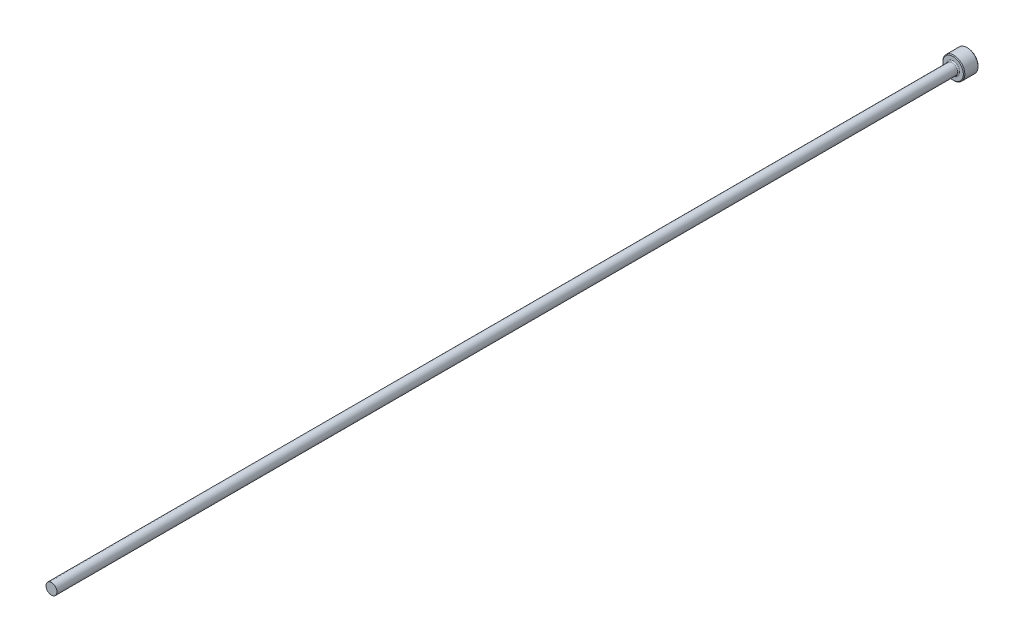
ISO-10303-21;
HEADER;
FILE_DESCRIPTION(('STEP AP214'),'2;1');
FILE_NAME('part.step','',(''),(''),'','','');
FILE_SCHEMA(('AUTOMOTIVE_DESIGN { 1 0 10303 214 1 1 1 1 }'));
ENDSEC;
DATA;
#1=APPLICATION_CONTEXT('core data for automotive mechanical design processes');
#2=APPLICATION_PROTOCOL_DEFINITION('international standard','automotive_design',2000,#1);
#3=PRODUCT_CONTEXT('',#1,'mechanical');
#4=PRODUCT('Part','Part','',(#3));
#5=PRODUCT_RELATED_PRODUCT_CATEGORY('part','',(#4));
#6=PRODUCT_DEFINITION_FORMATION('','',#4);
#7=PRODUCT_DEFINITION_CONTEXT('part definition',#1,'design');
#8=PRODUCT_DEFINITION('design','',#6,#7);
#9=PRODUCT_DEFINITION_SHAPE('','',#8);
#10=(LENGTH_UNIT() NAMED_UNIT(*) SI_UNIT(.MILLI.,.METRE.));
#11=(NAMED_UNIT(*) PLANE_ANGLE_UNIT() SI_UNIT($,.RADIAN.));
#12=(NAMED_UNIT(*) SI_UNIT($,.STERADIAN.) SOLID_ANGLE_UNIT());
#13=UNCERTAINTY_MEASURE_WITH_UNIT(LENGTH_MEASURE(1.E-05),#10,'distance_accuracy_value','');
#14=(GEOMETRIC_REPRESENTATION_CONTEXT(3) GLOBAL_UNCERTAINTY_ASSIGNED_CONTEXT((#13)) GLOBAL_UNIT_ASSIGNED_CONTEXT((#10,
#11,#12)) REPRESENTATION_CONTEXT('',''));
#15=CARTESIAN_POINT('',(0.,0.,0.));
#16=DIRECTION('',(0.,0.,1.));
#17=DIRECTION('',(1.,0.,0.));
#18=AXIS2_PLACEMENT_3D('',#15,#16,#17);
#19=CARTESIAN_POINT('',(0.,1.49999999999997,250.));
#20=DIRECTION('',(0.,0.,-1.));
#21=DIRECTION('',(-1.,0.,0.));
#22=AXIS2_PLACEMENT_3D('',#19,#20,#21);
#23=PLANE('',#22);
#24=CARTESIAN_POINT('',(0.,0.,250.));
#25=DIRECTION('',(0.,0.,1.));
#26=DIRECTION('',(1.,0.,0.));
#27=AXIS2_PLACEMENT_3D('',#24,#25,#26);
#28=CIRCLE('',#27,1.49999999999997);
#29=CARTESIAN_POINT('',(1.49999999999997,0.,250.));
#30=VERTEX_POINT('',#29);
#31=EDGE_CURVE('E50',#30,#30,#28,.T.);
#32=ORIENTED_EDGE('',*,*,#31,.T.);
#33=EDGE_LOOP('',(#32));
#34=FACE_BOUND('',#33,.T.);
#35=ADVANCED_FACE('F30',(#34),#23,.F.);
#36=CARTESIAN_POINT('',(0.,0.,109.050628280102));
#37=DIRECTION('',(0.,0.,1.));
#38=DIRECTION('',(1.,0.,0.));
#39=AXIS2_PLACEMENT_3D('',#36,#37,#38);
#40=CYLINDRICAL_SURFACE('',#39,1.49999999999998);
#41=ORIENTED_EDGE('',*,*,#31,.F.);
#42=EDGE_LOOP('',(#41));
#43=FACE_BOUND('',#42,.T.);
#44=CARTESIAN_POINT('',(0.,0.,4.3));
#45=DIRECTION('',(0.,0.,1.));
#46=DIRECTION('',(1.,0.,0.));
#47=AXIS2_PLACEMENT_3D('',#44,#45,#46);
#48=CIRCLE('',#47,1.5);
#49=CARTESIAN_POINT('',(1.5,0.,4.3));
#50=VERTEX_POINT('',#49);
#51=EDGE_CURVE('E53',#50,#50,#48,.T.);
#52=ORIENTED_EDGE('',*,*,#51,.T.);
#53=EDGE_LOOP('',(#52));
#54=FACE_BOUND('',#53,.T.);
#55=ADVANCED_FACE('F73',(#43,#54),#40,.T.);
#56=CARTESIAN_POINT('',(0.,0.,4.3));
#57=DIRECTION('',(0.,0.,1.));
#58=DIRECTION('',(1.,0.,0.));
#59=AXIS2_PLACEMENT_3D('',#56,#57,#58);
#60=TOROIDAL_SURFACE('',#59,1.8,0.3);
#61=ORIENTED_EDGE('',*,*,#51,.F.);
#62=EDGE_LOOP('',(#61));
#63=FACE_BOUND('',#62,.T.);
#64=CARTESIAN_POINT('',(0.,0.,4.));
#65=DIRECTION('',(0.,0.,1.));
#66=DIRECTION('',(1.,0.,0.));
#67=AXIS2_PLACEMENT_3D('',#64,#65,#66);
#68=CIRCLE('',#67,1.8);
#69=CARTESIAN_POINT('',(1.8,0.,4.));
#70=VERTEX_POINT('',#69);
#71=EDGE_CURVE('E56',#70,#70,#68,.T.);
#72=ORIENTED_EDGE('',*,*,#71,.T.);
#73=EDGE_LOOP('',(#72));
#74=FACE_BOUND('',#73,.T.);
#75=ADVANCED_FACE('F60',(#63,#74),#60,.F.);
#76=CARTESIAN_POINT('',(0.,3.,4.));
#77=DIRECTION('',(0.,0.,-1.));
#78=DIRECTION('',(-1.,0.,0.));
#79=AXIS2_PLACEMENT_3D('',#76,#77,#78);
#80=PLANE('',#79);
#81=CARTESIAN_POINT('',(0.,0.,4.));
#82=DIRECTION('',(0.,0.,-1.));
#83=DIRECTION('',(-1.,0.,0.));
#84=AXIS2_PLACEMENT_3D('',#81,#82,#83);
#85=CIRCLE('',#84,2.8);
#86=CARTESIAN_POINT('',(-2.8,0.,4.));
#87=VERTEX_POINT('',#86);
#88=EDGE_CURVE('E10',#87,#87,#85,.F.);
#89=ORIENTED_EDGE('',*,*,#88,.T.);
#90=EDGE_LOOP('',(#89));
#91=FACE_BOUND('',#90,.T.);
#92=ORIENTED_EDGE('',*,*,#71,.F.);
#93=EDGE_LOOP('',(#92));
#94=FACE_BOUND('',#93,.T.);
#95=ADVANCED_FACE('F62',(#91,#94),#80,.F.);
#96=CARTESIAN_POINT('',(0.,0.,109.050628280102));
#97=DIRECTION('',(0.,0.,1.));
#98=DIRECTION('',(1.,0.,0.));
#99=AXIS2_PLACEMENT_3D('',#96,#97,#98);
#100=CYLINDRICAL_SURFACE('',#99,3.);
#101=CARTESIAN_POINT('',(0.,0.,0.20000000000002));
#102=DIRECTION('',(0.,0.,1.));
#103=DIRECTION('',(1.,0.,0.));
#104=AXIS2_PLACEMENT_3D('',#101,#102,#103);
#105=CIRCLE('',#104,3.);
#106=CARTESIAN_POINT('',(3.,0.,0.20000000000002));
#107=VERTEX_POINT('',#106);
#108=EDGE_CURVE('E41',#107,#107,#105,.T.);
#109=ORIENTED_EDGE('',*,*,#108,.T.);
#110=EDGE_LOOP('',(#109));
#111=FACE_BOUND('',#110,.T.);
#112=CARTESIAN_POINT('',(0.,0.,3.80000000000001));
#113=DIRECTION('',(0.,0.,-1.));
#114=DIRECTION('',(-1.,0.,0.));
#115=AXIS2_PLACEMENT_3D('',#112,#113,#114);
#116=CIRCLE('',#115,3.);
#117=CARTESIAN_POINT('',(-3.,0.,3.80000000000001));
#118=VERTEX_POINT('',#117);
#119=EDGE_CURVE('E45',#118,#118,#116,.T.);
#120=ORIENTED_EDGE('',*,*,#119,.T.);
#121=EDGE_LOOP('',(#120));
#122=FACE_BOUND('',#121,.T.);
#123=ADVANCED_FACE('F64',(#111,#122),#100,.T.);
#124=CARTESIAN_POINT('',(0.,0.,0.));
#125=DIRECTION('',(0.,0.,1.));
#126=DIRECTION('',(1.,0.,0.));
#127=AXIS2_PLACEMENT_3D('',#124,#125,#126);
#128=PLANE('',#127);
#129=CARTESIAN_POINT('',(0.,0.,0.));
#130=DIRECTION('',(0.,0.,1.));
#131=DIRECTION('',(1.,0.,0.));
#132=AXIS2_PLACEMENT_3D('',#129,#130,#131);
#133=CIRCLE('',#132,2.79999999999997);
#134=CARTESIAN_POINT('',(2.79999999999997,0.,0.));
#135=VERTEX_POINT('',#134);
#136=EDGE_CURVE('E37',#135,#135,#133,.F.);
#137=ORIENTED_EDGE('',*,*,#136,.T.);
#138=EDGE_LOOP('',(#137));
#139=FACE_BOUND('',#138,.T.);
#140=ADVANCED_FACE('F70',(#139),#128,.F.);
#141=CARTESIAN_POINT('',(0.,0.,0.20000000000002));
#142=DIRECTION('',(0.,0.,1.));
#143=DIRECTION('',(1.,0.,0.));
#144=AXIS2_PLACEMENT_3D('',#141,#142,#143);
#145=CONICAL_SURFACE('',#144,3.,0.785398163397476);
#146=ORIENTED_EDGE('',*,*,#136,.F.);
#147=EDGE_LOOP('',(#146));
#148=FACE_BOUND('',#147,.T.);
#149=ORIENTED_EDGE('',*,*,#108,.F.);
#150=EDGE_LOOP('',(#149));
#151=FACE_BOUND('',#150,.T.);
#152=ADVANCED_FACE('F84',(#148,#151),#145,.T.);
#153=CARTESIAN_POINT('',(0.,0.,4.));
#154=DIRECTION('',(0.,0.,-1.));
#155=DIRECTION('',(-1.,0.,0.));
#156=AXIS2_PLACEMENT_3D('',#153,#154,#155);
#157=CONICAL_SURFACE('',#156,2.8,0.785398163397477);
#158=ORIENTED_EDGE('',*,*,#119,.F.);
#159=EDGE_LOOP('',(#158));
#160=FACE_BOUND('',#159,.T.);
#161=ORIENTED_EDGE('',*,*,#88,.F.);
#162=EDGE_LOOP('',(#161));
#163=FACE_BOUND('',#162,.T.);
#164=ADVANCED_FACE('F32',(#160,#163),#157,.T.);
#165=CLOSED_SHELL('',(#35,#55,#75,#95,#123,#140,#152,#164));
#166=MANIFOLD_SOLID_BREP('B2',#165);
#167=ADVANCED_BREP_SHAPE_REPRESENTATION('',(#18,#166),#14);
#168=SHAPE_DEFINITION_REPRESENTATION(#9,#167);
ENDSEC;
END-ISO-10303-21;
